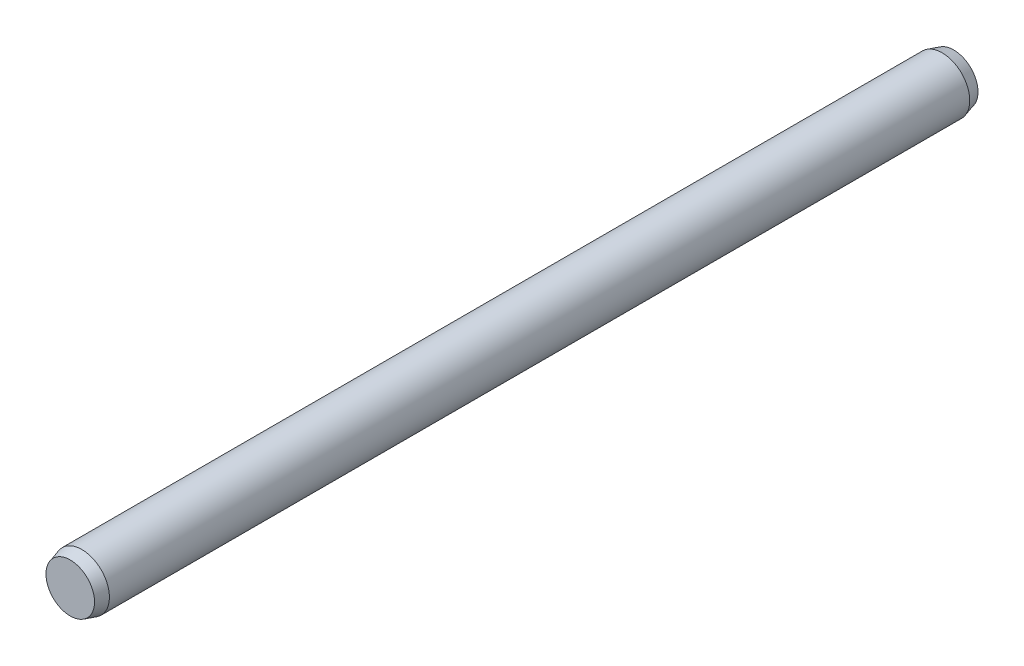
ISO-10303-21;
HEADER;
FILE_DESCRIPTION(('STEP AP214'),'2;1');
FILE_NAME('part.step','',(''),(''),'','','');
FILE_SCHEMA(('AUTOMOTIVE_DESIGN { 1 0 10303 214 1 1 1 1 }'));
ENDSEC;
DATA;
#1=APPLICATION_CONTEXT('core data for automotive mechanical design processes');
#2=APPLICATION_PROTOCOL_DEFINITION('international standard','automotive_design',2000,#1);
#3=PRODUCT_CONTEXT('',#1,'mechanical');
#4=PRODUCT('Part','Part','',(#3));
#5=PRODUCT_RELATED_PRODUCT_CATEGORY('part','',(#4));
#6=PRODUCT_DEFINITION_FORMATION('','',#4);
#7=PRODUCT_DEFINITION_CONTEXT('part definition',#1,'design');
#8=PRODUCT_DEFINITION('design','',#6,#7);
#9=PRODUCT_DEFINITION_SHAPE('','',#8);
#10=(LENGTH_UNIT() NAMED_UNIT(*) SI_UNIT(.MILLI.,.METRE.));
#11=(NAMED_UNIT(*) PLANE_ANGLE_UNIT() SI_UNIT($,.RADIAN.));
#12=(NAMED_UNIT(*) SI_UNIT($,.STERADIAN.) SOLID_ANGLE_UNIT());
#13=UNCERTAINTY_MEASURE_WITH_UNIT(LENGTH_MEASURE(1.E-05),#10,'distance_accuracy_value','');
#14=(GEOMETRIC_REPRESENTATION_CONTEXT(3) GLOBAL_UNCERTAINTY_ASSIGNED_CONTEXT((#13)) GLOBAL_UNIT_ASSIGNED_CONTEXT((#10,
#11,#12)) REPRESENTATION_CONTEXT('',''));
#15=CARTESIAN_POINT('',(0.,0.,0.));
#16=DIRECTION('',(0.,0.,1.));
#17=DIRECTION('',(1.,0.,0.));
#18=AXIS2_PLACEMENT_3D('',#15,#16,#17);
#19=CARTESIAN_POINT('',(0.,0.,25.4));
#20=DIRECTION('',(0.,0.,-1.));
#21=DIRECTION('',(-1.,0.,0.));
#22=AXIS2_PLACEMENT_3D('',#19,#20,#21);
#23=PLANE('',#22);
#24=CARTESIAN_POINT('',(0.,0.,25.4));
#25=DIRECTION('',(0.,0.,1.));
#26=DIRECTION('',(1.,0.,0.));
#27=AXIS2_PLACEMENT_3D('',#24,#25,#26);
#28=CIRCLE('',#27,1.397);
#29=CARTESIAN_POINT('',(1.397,0.,25.4));
#30=VERTEX_POINT('',#29);
#31=EDGE_CURVE('E10',#30,#30,#28,.T.);
#32=ORIENTED_EDGE('',*,*,#31,.T.);
#33=EDGE_LOOP('',(#32));
#34=FACE_BOUND('',#33,.T.);
#35=ADVANCED_FACE('F30',(#34),#23,.F.);
#36=CARTESIAN_POINT('',(0.,0.,24.7356475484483));
#37=DIRECTION('',(0.,0.,-1.));
#38=DIRECTION('',(-1.,0.,0.));
#39=AXIS2_PLACEMENT_3D('',#36,#37,#38);
#40=CONICAL_SURFACE('',#39,1.5875,0.27925268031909);
#41=ORIENTED_EDGE('',*,*,#31,.F.);
#42=EDGE_LOOP('',(#41));
#43=FACE_BOUND('',#42,.T.);
#44=CARTESIAN_POINT('',(0.,0.,24.7356475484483));
#45=DIRECTION('',(0.,0.,1.));
#46=DIRECTION('',(1.,0.,0.));
#47=AXIS2_PLACEMENT_3D('',#44,#45,#46);
#48=CIRCLE('',#47,1.5875);
#49=CARTESIAN_POINT('',(1.5875,0.,24.7356475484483));
#50=VERTEX_POINT('',#49);
#51=EDGE_CURVE('E36',#50,#50,#48,.T.);
#52=ORIENTED_EDGE('',*,*,#51,.T.);
#53=EDGE_LOOP('',(#52));
#54=FACE_BOUND('',#53,.T.);
#55=ADVANCED_FACE('F62',(#43,#54),#40,.T.);
#56=CARTESIAN_POINT('',(0.,0.,25.4));
#57=DIRECTION('',(0.,0.,1.));
#58=DIRECTION('',(1.,0.,0.));
#59=AXIS2_PLACEMENT_3D('',#56,#57,#58);
#60=CYLINDRICAL_SURFACE('',#59,1.5875);
#61=ORIENTED_EDGE('',*,*,#51,.F.);
#62=EDGE_LOOP('',(#61));
#63=FACE_BOUND('',#62,.T.);
#64=CARTESIAN_POINT('',(0.,0.,-24.7356475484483));
#65=DIRECTION('',(0.,0.,1.));
#66=DIRECTION('',(1.,0.,0.));
#67=AXIS2_PLACEMENT_3D('',#64,#65,#66);
#68=CIRCLE('',#67,1.5875);
#69=CARTESIAN_POINT('',(1.5875,0.,-24.7356475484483));
#70=VERTEX_POINT('',#69);
#71=EDGE_CURVE('E40',#70,#70,#68,.T.);
#72=ORIENTED_EDGE('',*,*,#71,.T.);
#73=EDGE_LOOP('',(#72));
#74=FACE_BOUND('',#73,.T.);
#75=ADVANCED_FACE('F58',(#63,#74),#60,.T.);
#76=CARTESIAN_POINT('',(0.,0.,-25.4));
#77=DIRECTION('',(0.,0.,1.));
#78=DIRECTION('',(1.,0.,0.));
#79=AXIS2_PLACEMENT_3D('',#76,#77,#78);
#80=CONICAL_SURFACE('',#79,1.397,0.27925268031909);
#81=ORIENTED_EDGE('',*,*,#71,.F.);
#82=EDGE_LOOP('',(#81));
#83=FACE_BOUND('',#82,.T.);
#84=CARTESIAN_POINT('',(0.,0.,-25.4));
#85=DIRECTION('',(0.,0.,1.));
#86=DIRECTION('',(1.,0.,0.));
#87=AXIS2_PLACEMENT_3D('',#84,#85,#86);
#88=CIRCLE('',#87,1.397);
#89=CARTESIAN_POINT('',(1.397,0.,-25.4));
#90=VERTEX_POINT('',#89);
#91=EDGE_CURVE('E44',#90,#90,#88,.T.);
#92=ORIENTED_EDGE('',*,*,#91,.T.);
#93=EDGE_LOOP('',(#92));
#94=FACE_BOUND('',#93,.T.);
#95=ADVANCED_FACE('F50',(#83,#94),#80,.T.);
#96=CARTESIAN_POINT('',(0.,1.397,-25.4));
#97=DIRECTION('',(0.,0.,1.));
#98=DIRECTION('',(1.,0.,0.));
#99=AXIS2_PLACEMENT_3D('',#96,#97,#98);
#100=PLANE('',#99);
#101=ORIENTED_EDGE('',*,*,#91,.F.);
#102=EDGE_LOOP('',(#101));
#103=FACE_BOUND('',#102,.T.);
#104=ADVANCED_FACE('F52',(#103),#100,.F.);
#105=CLOSED_SHELL('',(#35,#55,#75,#95,#104));
#106=MANIFOLD_SOLID_BREP('B2',#105);
#107=ADVANCED_BREP_SHAPE_REPRESENTATION('',(#18,#106),#14);
#108=SHAPE_DEFINITION_REPRESENTATION(#9,#107);
ENDSEC;
END-ISO-10303-21;
